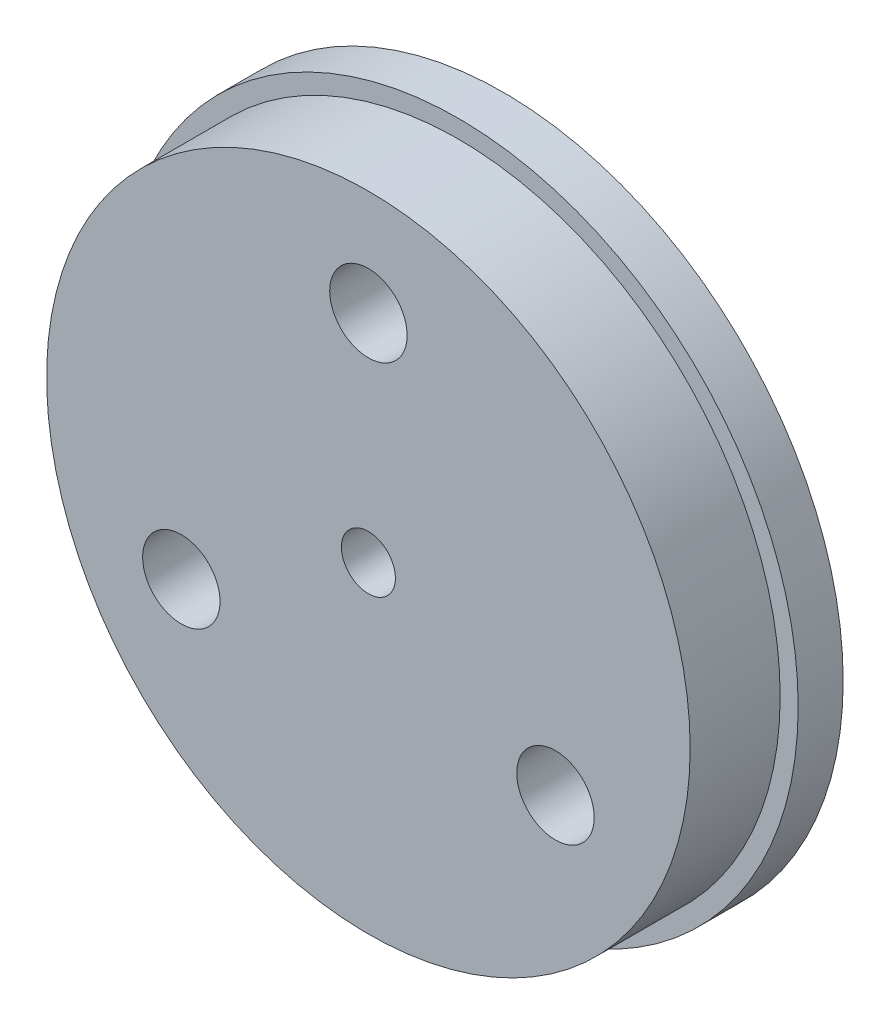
from build123d import *

# Parameters (mm, degrees)
SKETCH1_R           = 37.75
SKETCH1_R_2         = 3
SKETCH1_R_3         = 4.3
BOSS_EXTRUDE1_DEPTH = 5
SKETCH5_R           = 35.75
SKETCH5_R_2         = 3
SKETCH5_R_3         = 4.3
BOSS_EXTRUDE3_DEPTH = 10
CUT_EXTRUDE4_DEPTH  = 3
SKETCH4_R           = 8.75
CUT_EXTRUDE7_DEPTH  = 1.5


with BuildPart() as part:
    # Sketch1 → Boss-Extrude1 (new body)
    with BuildSketch(Plane.XY):
        Circle(SKETCH1_R)
        Circle(SKETCH1_R_2, mode=Mode.SUBTRACT)
        with Locations((0, 24)):
            Circle(SKETCH1_R_3, mode=Mode.SUBTRACT)
        with Locations((20.784609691, -12)):
            Circle(SKETCH1_R_3, mode=Mode.SUBTRACT)
        with Locations((-20.784609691, -12)):
            Circle(SKETCH1_R_3, mode=Mode.SUBTRACT)
    extrude(amount=BOSS_EXTRUDE1_DEPTH)

    # Sketch5 → Boss-Extrude3 (add)
    with BuildSketch(Plane.XY.offset(5)):
        Circle(SKETCH5_R)
        Circle(SKETCH5_R_2, mode=Mode.SUBTRACT)
        with Locations((-20.784609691, -12)):
            Circle(SKETCH5_R_3, mode=Mode.SUBTRACT)
        with Locations((20.784609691, -12)):
            Circle(SKETCH5_R_3, mode=Mode.SUBTRACT)
        with Locations((0, 24)):
            Circle(SKETCH5_R_3, mode=Mode.SUBTRACT)
    extrude(amount=BOSS_EXTRUDE3_DEPTH)

    # Sketch2 → Cut-Extrude4 (cut)
    with BuildSketch(Plane(origin=(0, 0, 0), x_dir=(-1, 0, 0), z_dir=(0, 0, -1))):
        with BuildLine():
            Line((-27.37318269, -19.851955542), (-26.248304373, -18.511377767))
            ThreePointArc((-26.248304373, -18.511377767), (-20.784609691, -20.5), (-15.320915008, -18.511377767))
            Line((-15.320915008, -18.511377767), (-14.196036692, -19.851955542))
            ThreePointArc((-14.196036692, -19.851955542), (-20.784609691, -22.25), (-27.37318269, -19.851955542))
        make_face()
        with BuildLine():
            Line((-10.143108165, 22.220106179), (-8.420421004, 22.523862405))
            ThreePointArc((-8.420421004, 22.523862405), (-7.412836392, 28.258207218), (-2.966946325, 32.017462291))
            Line((-2.966946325, 32.017462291), (-3.554535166, 33.631849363))
            ThreePointArc((-3.554535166, 33.631849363), (-8.925589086, 29.125), (-10.143108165, 22.220106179))
        make_face()
        with BuildLine():
            Line((24.265901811, -2.325863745), (23.656603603, -3.999896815))
            ThreePointArc((23.656603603, -3.999896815), (28.127051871, -7.717647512), (29.161889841, -13.439158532))
            Line((29.161889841, -13.439158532), (30.854474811, -13.737606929))
            ThreePointArc((30.854474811, -13.737606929), (29.636955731, -6.832713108), (24.265901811, -2.325863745))
        make_face()
    extrude(amount=-CUT_EXTRUDE4_DEPTH, mode=Mode.SUBTRACT)

    # Sketch4 → Cut-Extrude7 (cut)
    with BuildSketch(Plane(origin=(0, 0, 0), x_dir=(-1, 0, 0), z_dir=(0, 0, -1))):
        with Locations((-20.784609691, -12)):
            Circle(SKETCH4_R)
        with Locations((0, 24)):
            Circle(SKETCH4_R)
        with Locations((20.784609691, -12)):
            Circle(SKETCH4_R)
    extrude(amount=-CUT_EXTRUDE7_DEPTH, mode=Mode.SUBTRACT)


solid = part.part
